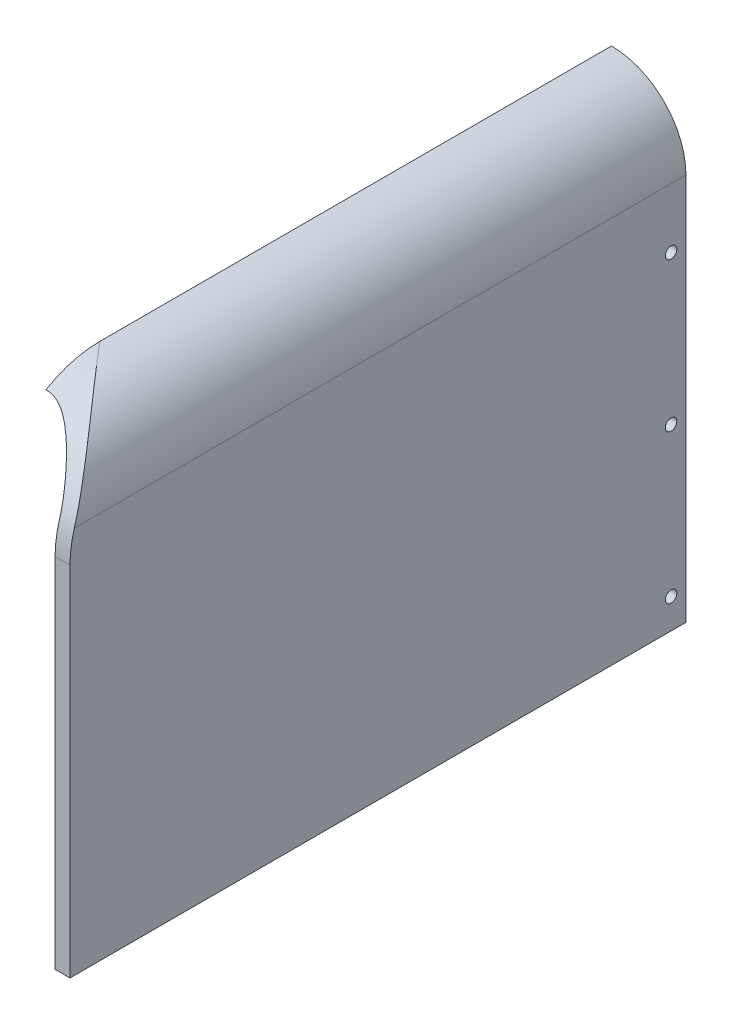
from build123d import *

# Parameters (mm, degrees)
SKETCH1_W      = 525.018
SKETCH1_H      = 304.8
EXTRUDE1_DEPTH = 12.7
SKETCH2_R      = 4.9022
EXTRUDE2_DEPTH = 608.213496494
EXTRUDE3_DEPTH = 525.018
EXTRUDE4_DEPTH = 660.299507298


with BuildPart() as part:
    # Sketch1 → Extrude1 (new body)
    with BuildSketch(Plane(origin=(0, 0, 0), x_dir=(0, 0, -1), z_dir=(1, 0, 0))):
        with Locations((262.509, 152.4)):
            Rectangle(SKETCH1_W, SKETCH1_H)
    extrude(amount=EXTRUDE1_DEPTH)

    # Sketch2 → Extrude2 (cut, through all)
    with BuildSketch(Plane.ZY):
        with Locations((-512.318, 25.4)):
            Circle(SKETCH2_R)
        with Locations((-512.318, 279.4)):
            Circle(SKETCH2_R)
        with Locations((-512.318, 152.4)):
            Circle(SKETCH2_R)
    extrude(amount=-EXTRUDE2_DEPTH, mode=Mode.SUBTRACT)

    # Sketch3 → Extrude3 (add)
    with BuildSketch(Plane(origin=(0, 0, -525.018), x_dir=(-1, 0, 0), z_dir=(0, 0, -1))):
        with BuildLine():
            Line((0, 304.8), (-12.7, 304.8))
            Line((-12.7, 304.8), (-12.7, 330.2))
            ThreePointArc((-12.7, 330.2), (5.898719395, 375.101280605), (50.8, 393.7))
            Line((50.8, 393.7), (50.8, 381))
            ThreePointArc((50.8, 381), (14.878975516, 366.121024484), (0, 330.2))
            Line((0, 330.2), (0, 304.8))
        make_face()
    extrude(amount=-EXTRUDE3_DEPTH)

    # Sketch4 → Extrude4 (cut, through all)
    with BuildSketch(Plane(origin=(12.7, 0, 0), x_dir=(0, 0, -1), z_dir=(1, 0, 0))):
        with BuildLine():
            Line((0, 304.8), (-24.22466211, 304.8))
            Line((-24.22466211, 304.8), (-24.22466211, 407.826543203))
            Line((-24.22466211, 407.826543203), (88.9, 407.826543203))
            Line((88.9, 407.826543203), (88.9, 393.7))
            ThreePointArc((88.9, 393.7), (26.038207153, 367.661792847), (0, 304.8))
        make_face()
    extrude(amount=-EXTRUDE4_DEPTH, mode=Mode.SUBTRACT)


solid = part.part
